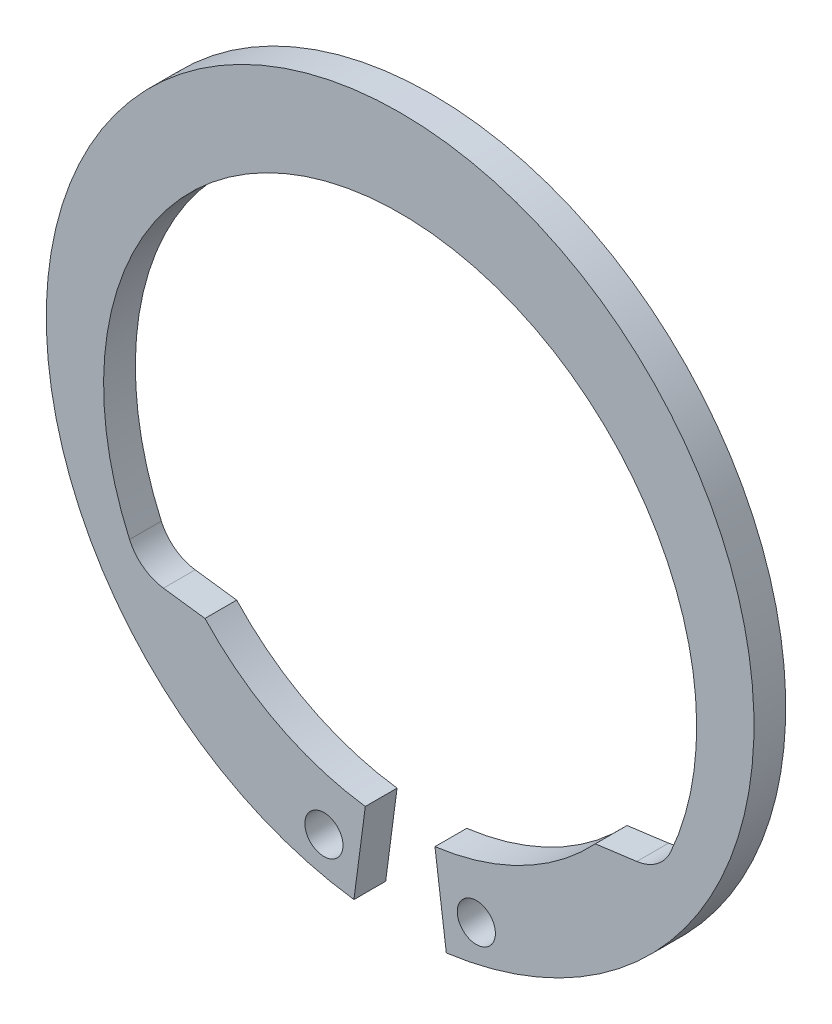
from build123d import *

# Parameters (mm, degrees)
BODYSKE_R  = 0.5334
BODY_DEPTH = 0.889


with BuildPart() as part:
    # BodySke → Body (new body)
    with BuildSketch(Plane.XY):
        with BuildLine():
            Line((-0.974717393, -7.403713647), (-1.29299246, -9.821252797))
            ThreePointArc((-1.29299246, -9.821252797), (0, 9.906), (1.29299246, -9.821252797))
            Line((1.29299246, -9.821252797), (0.974717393, -7.403713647))
            ThreePointArc((0.974717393, -7.403713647), (3.420903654, -6.63795661), (5.464040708, -5.090118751))
            Line((5.464040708, -5.090118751), (6.625562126, -4.937201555))
            ThreePointArc((6.625562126, -4.937201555), (7.192072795, -4.707317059), (7.574660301, -4.230443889))
            ThreePointArc((7.574660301, -4.230443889), (0, 7.4676), (-7.574660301, -4.230443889))
            ThreePointArc((-7.574660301, -4.230443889), (-7.192072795, -4.707317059), (-6.625562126, -4.937201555))
            Line((-6.625562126, -4.937201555), (-5.464040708, -5.090118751))
            ThreePointArc((-5.464040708, -5.090118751), (-3.420903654, -6.63795661), (-0.974717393, -7.403713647))
        make_face()
        with Locations((2.133243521, -8.662961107)):
            Circle(BODYSKE_R, mode=Mode.SUBTRACT)
        with Locations((-2.133243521, -8.662961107)):
            Circle(BODYSKE_R, mode=Mode.SUBTRACT)
    extrude(amount=-BODY_DEPTH)


solid = part.part
